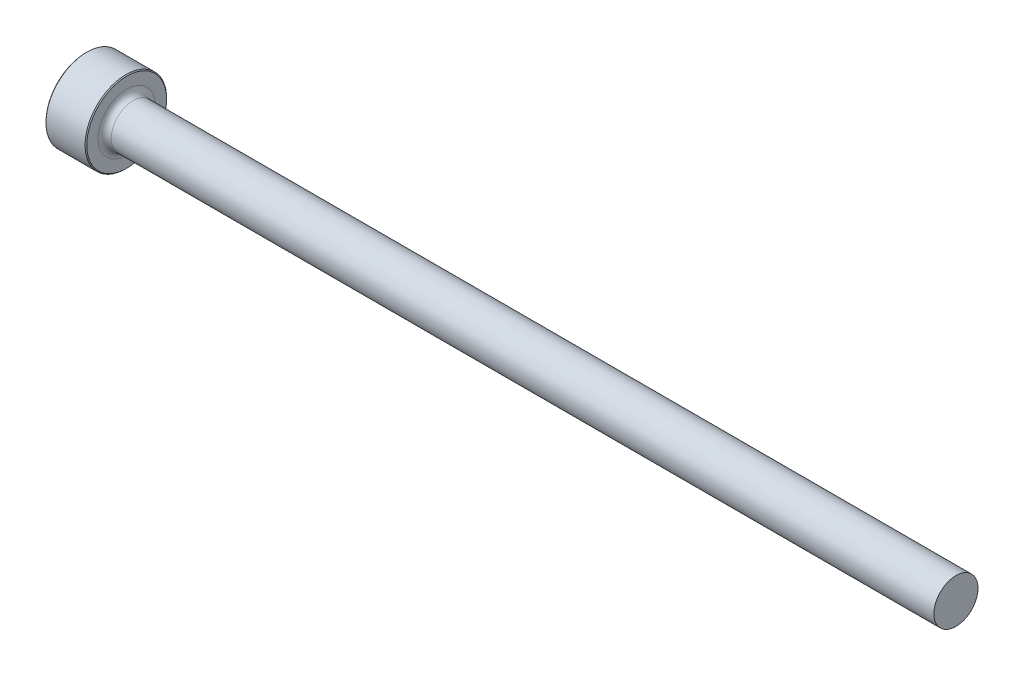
from build123d import *

# Parameters (mm, degrees)
CHAMFER1_SIZE = 0.1016


with BuildPart() as part:
    # Sketch1 → Revolve1 (revolve)
    with BuildSketch(Plane.XY):
        with BuildLine():
            Line((0, 0), (0, 4.7625))
            Line((0, 4.7625), (4.7625, 4.7625))
            Line((4.7625, 4.7625), (4.7625, 3.3378775))
            ThreePointArc((4.7625, 3.3378775), (4.985684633, 2.799062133), (5.5245, 2.5758775))
            Line((5.5245, 2.5758775), (101.6, 2.5758775))
            Line((101.6, 2.5758775), (101.6, 0))
            Line((101.6, 0), (0, 0))
        make_face()
    revolve(axis=Axis((101.6, 0, 0), (-1, 0, 0)))

    # Chamfer1
    chamfer1_edges = [part.edges().sort_by_distance(p)[0] for p in [
        (0, -4.7625, 0),
        (4.7625, -4.7625, 0),
    ]]
    chamfer(chamfer1_edges, length=CHAMFER1_SIZE)


solid = part.part
